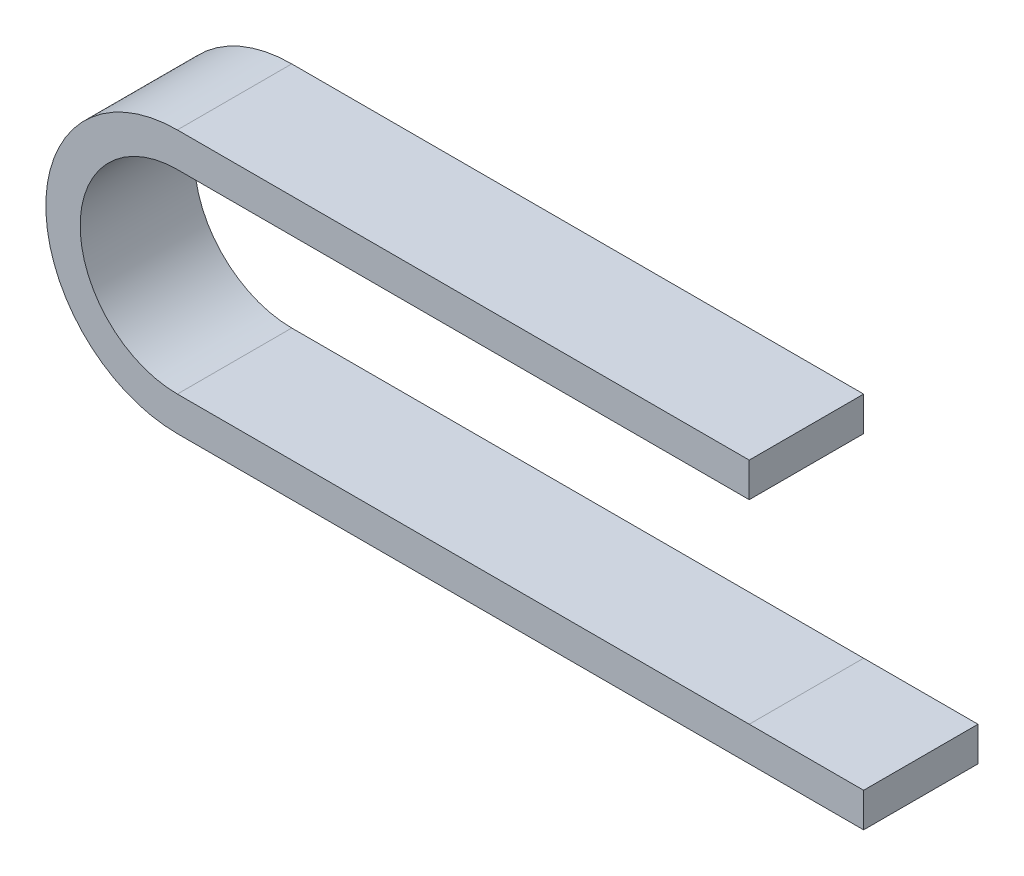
from build123d import *

# Parameters (mm, degrees)
SKETCH2_W = 5
SKETCH2_H = 1.5


with BuildPart() as part:
    # Base-Sweep: sweep along a path in Sketch1
    with BuildLine(Plane.XY) as base_sweep_path:
        Line((30, 0), (0, 0))
        ThreePointArc((0, 0), (-5, 5), (0, 10))
        Line((0, 10), (25, 10))
    # Sketch2 → Base-Sweep (sweep)
    with BuildSketch(Plane(origin=(30, 0, 0), x_dir=(0, 0, -1), z_dir=(1, 0, 0))):
        Rectangle(SKETCH2_W, SKETCH2_H)
    sweep(path=base_sweep_path.line)


solid = part.part
